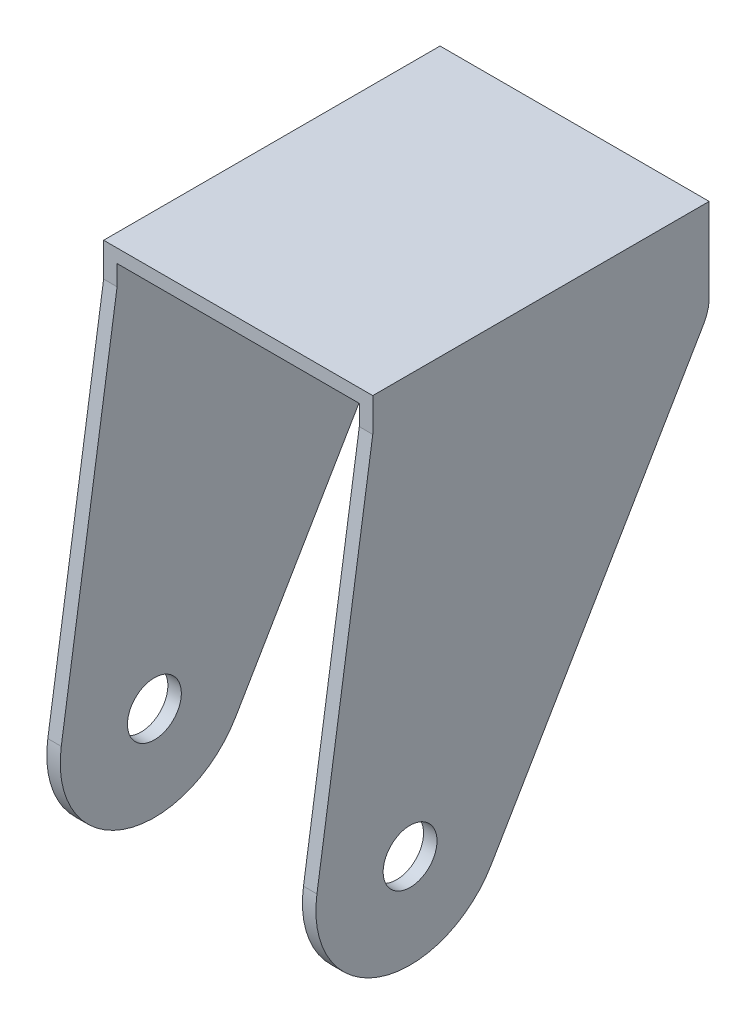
ISO-10303-21;
HEADER;
FILE_DESCRIPTION(('STEP AP214'),'2;1');
FILE_NAME('part.step','',(''),(''),'','','');
FILE_SCHEMA(('AUTOMOTIVE_DESIGN { 1 0 10303 214 1 1 1 1 }'));
ENDSEC;
DATA;
#1=APPLICATION_CONTEXT('core data for automotive mechanical design processes');
#2=APPLICATION_PROTOCOL_DEFINITION('international standard','automotive_design',2000,#1);
#3=PRODUCT_CONTEXT('',#1,'mechanical');
#4=PRODUCT('Part','Part','',(#3));
#5=PRODUCT_RELATED_PRODUCT_CATEGORY('part','',(#4));
#6=PRODUCT_DEFINITION_FORMATION('','',#4);
#7=PRODUCT_DEFINITION_CONTEXT('part definition',#1,'design');
#8=PRODUCT_DEFINITION('design','',#6,#7);
#9=PRODUCT_DEFINITION_SHAPE('','',#8);
#10=(LENGTH_UNIT() NAMED_UNIT(*) SI_UNIT(.MILLI.,.METRE.));
#11=(NAMED_UNIT(*) PLANE_ANGLE_UNIT() SI_UNIT($,.RADIAN.));
#12=(NAMED_UNIT(*) SI_UNIT($,.STERADIAN.) SOLID_ANGLE_UNIT());
#13=UNCERTAINTY_MEASURE_WITH_UNIT(LENGTH_MEASURE(1.E-05),#10,'distance_accuracy_value','');
#14=(GEOMETRIC_REPRESENTATION_CONTEXT(3) GLOBAL_UNCERTAINTY_ASSIGNED_CONTEXT((#13)) GLOBAL_UNIT_ASSIGNED_CONTEXT((#10,
#11,#12)) REPRESENTATION_CONTEXT('',''));
#15=CARTESIAN_POINT('',(0.,0.,0.));
#16=DIRECTION('',(0.,0.,1.));
#17=DIRECTION('',(1.,0.,0.));
#18=AXIS2_PLACEMENT_3D('',#15,#16,#17);
#19=CARTESIAN_POINT('',(0.,60.0885017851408,0.));
#20=DIRECTION('',(0.,1.,0.));
#21=DIRECTION('',(0.,0.,1.));
#22=AXIS2_PLACEMENT_3D('',#19,#20,#21);
#23=PLANE('',#22);
#24=DIRECTION('',(-0.466127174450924,0.,0.884717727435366));
#25=VECTOR('',#24,1.);
#26=CARTESIAN_POINT('',(-19.6951823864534,60.0885017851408,-10.3767104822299));
#27=LINE('',#26,#25);
#28=CARTESIAN_POINT('',(-9.64384241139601,60.0885017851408,-29.4543338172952));
#29=VERTEX_POINT('',#28);
#30=CARTESIAN_POINT('',(-18.,60.0885017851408,-13.5941970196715));
#31=VERTEX_POINT('',#30);
#32=EDGE_CURVE('E249',#29,#31,#27,.T.);
#33=ORIENTED_EDGE('',*,*,#32,.T.);
#34=CARTESIAN_POINT('',(-20.,60.0885017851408,-23.3921559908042));
#35=DIRECTION('',(0.,1.,0.));
#36=DIRECTION('',(0.,0.,1.));
#37=AXIS2_PLACEMENT_3D('',#34,#35,#36);
#38=CIRCLE('',#37,10.);
#39=CARTESIAN_POINT('',(-22.,60.0885017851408,-13.5941970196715));
#40=VERTEX_POINT('',#39);
#41=EDGE_CURVE('E230',#31,#40,#38,.F.);
#42=ORIENTED_EDGE('',*,*,#41,.T.);
#43=DIRECTION('',(-0.466127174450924,0.,-0.884717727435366));
#44=VECTOR('',#43,1.);
#45=CARTESIAN_POINT('',(-11.6138359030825,60.0885017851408,6.11892849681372));
#46=LINE('',#45,#44);
#47=CARTESIAN_POINT('',(-30.356157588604,60.0885017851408,-29.4543338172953));
#48=VERTEX_POINT('',#47);
#49=EDGE_CURVE('E255',#40,#48,#46,.T.);
#50=ORIENTED_EDGE('',*,*,#49,.T.);
#51=CARTESIAN_POINT('',(-20.,60.0885017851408,-23.3921559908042));
#52=DIRECTION('',(0.,1.,0.));
#53=DIRECTION('',(0.,0.,1.));
#54=AXIS2_PLACEMENT_3D('',#51,#52,#53);
#55=CIRCLE('',#54,12.);
#56=EDGE_CURVE('E252',#48,#29,#55,.T.);
#57=ORIENTED_EDGE('',*,*,#56,.T.);
#58=EDGE_LOOP('',(#33,#42,#50,#57));
#59=FACE_BOUND('',#58,.T.);
#60=DIRECTION('',(0.,0.,1.));
#61=VECTOR('',#60,1.);
#62=CARTESIAN_POINT('',(-38.,60.0885017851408,0.));
#63=LINE('',#62,#61);
#64=CARTESIAN_POINT('',(-38.,60.0885017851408,-44.4543338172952));
#65=VERTEX_POINT('',#64);
#66=CARTESIAN_POINT('',(-38.,60.0885017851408,5.54566618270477));
#67=VERTEX_POINT('',#66);
#68=EDGE_CURVE('E13',#65,#67,#63,.T.);
#69=ORIENTED_EDGE('',*,*,#68,.F.);
#70=DIRECTION('',(-1.,0.,0.));
#71=VECTOR('',#70,1.);
#72=CARTESIAN_POINT('',(-40.,60.0885017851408,-44.4543338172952));
#73=LINE('',#72,#71);
#74=CARTESIAN_POINT('',(-2.,60.0885017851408,-44.4543338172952));
#75=VERTEX_POINT('',#74);
#76=EDGE_CURVE('E191',#75,#65,#73,.T.);
#77=ORIENTED_EDGE('',*,*,#76,.F.);
#78=DIRECTION('',(0.,0.,1.));
#79=VECTOR('',#78,1.);
#80=CARTESIAN_POINT('',(-2.,60.0885017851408,0.));
#81=LINE('',#80,#79);
#82=CARTESIAN_POINT('',(-2.,60.0885017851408,5.54566618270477));
#83=VERTEX_POINT('',#82);
#84=EDGE_CURVE('E139',#75,#83,#81,.T.);
#85=ORIENTED_EDGE('',*,*,#84,.T.);
#86=DIRECTION('',(1.,0.,0.));
#87=VECTOR('',#86,1.);
#88=CARTESIAN_POINT('',(-40.,60.0885017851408,5.54566618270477));
#89=LINE('',#88,#87);
#90=EDGE_CURVE('E197',#67,#83,#89,.T.);
#91=ORIENTED_EDGE('',*,*,#90,.F.);
#92=EDGE_LOOP('',(#69,#77,#85,#91));
#93=FACE_BOUND('',#92,.T.);
#94=ADVANCED_FACE('F47',(#59,#93),#23,.F.);
#95=CARTESIAN_POINT('',(-2.,0.,0.));
#96=DIRECTION('',(1.,0.,0.));
#97=DIRECTION('',(0.,0.,-1.));
#98=AXIS2_PLACEMENT_3D('',#95,#96,#97);
#99=PLANE('',#98);
#100=CARTESIAN_POINT('',(-2.,0.,0.));
#101=DIRECTION('',(1.,0.,0.));
#102=DIRECTION('',(0.,0.,-1.));
#103=AXIS2_PLACEMENT_3D('',#100,#101,#102);
#104=CIRCLE('',#103,4.);
#105=CARTESIAN_POINT('',(-2.,0.,-4.00000000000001));
#106=VERTEX_POINT('',#105);
#107=EDGE_CURVE('E279',#106,#106,#104,.T.);
#108=ORIENTED_EDGE('',*,*,#107,.T.);
#109=EDGE_LOOP('',(#108));
#110=FACE_BOUND('',#109,.T.);
#111=ORIENTED_EDGE('',*,*,#84,.F.);
#112=DIRECTION('',(0.,1.,0.));
#113=VECTOR('',#112,1.);
#114=CARTESIAN_POINT('',(-2.,62.0885017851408,-44.4543338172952));
#115=LINE('',#114,#113);
#116=CARTESIAN_POINT('',(-2.,49.7190718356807,-44.4543338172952));
#117=VERTEX_POINT('',#116);
#118=EDGE_CURVE('E122',#117,#75,#115,.T.);
#119=ORIENTED_EDGE('',*,*,#118,.F.);
#120=CARTESIAN_POINT('',(-2.,49.7190718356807,-38.4543338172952));
#121=DIRECTION('',(1.,0.,0.));
#122=DIRECTION('',(0.,0.,1.));
#123=AXIS2_PLACEMENT_3D('',#120,#121,#122);
#124=CIRCLE('',#123,6.);
#125=CARTESIAN_POINT('',(-2.,46.6822168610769,-43.6290330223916));
#126=VERTEX_POINT('',#125);
#127=EDGE_CURVE('E136',#126,#117,#124,.T.);
#128=ORIENTED_EDGE('',*,*,#127,.F.);
#129=DIRECTION('',(0.,0.862449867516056,-0.506142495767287));
#130=VECTOR('',#129,1.);
#131=CARTESIAN_POINT('',(-2.,46.6822168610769,-43.6290330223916));
#132=LINE('',#131,#130);
#133=CARTESIAN_POINT('',(-2.,-7.08599494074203,-12.0742981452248));
#134=VERTEX_POINT('',#133);
#135=EDGE_CURVE('E143',#134,#126,#132,.T.);
#136=ORIENTED_EDGE('',*,*,#135,.F.);
#137=CARTESIAN_POINT('',(-2.,0.,0.));
#138=DIRECTION('',(1.,0.,0.));
#139=DIRECTION('',(0.,0.,-1.));
#140=AXIS2_PLACEMENT_3D('',#137,#138,#139);
#141=CIRCLE('',#140,14.);
#142=CARTESIAN_POINT('',(-2.,2.08850178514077,13.8433435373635));
#143=VERTEX_POINT('',#142);
#144=EDGE_CURVE('E145',#143,#134,#141,.T.);
#145=ORIENTED_EDGE('',*,*,#144,.F.);
#146=DIRECTION('',(0.,-0.988810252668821,0.149178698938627));
#147=VECTOR('',#146,1.);
#148=CARTESIAN_POINT('',(-2.,2.08850178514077,13.8433435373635));
#149=LINE('',#148,#147);
#150=CARTESIAN_POINT('',(-2.,57.0885017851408,5.54566618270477));
#151=VERTEX_POINT('',#150);
#152=EDGE_CURVE('E150',#151,#143,#149,.T.);
#153=ORIENTED_EDGE('',*,*,#152,.F.);
#154=DIRECTION('',(0.,-1.,0.));
#155=VECTOR('',#154,1.);
#156=CARTESIAN_POINT('',(-2.,57.0885017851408,5.54566618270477));
#157=LINE('',#156,#155);
#158=EDGE_CURVE('E140',#83,#151,#157,.T.);
#159=ORIENTED_EDGE('',*,*,#158,.F.);
#160=EDGE_LOOP('',(#111,#119,#128,#136,#145,#153,#159));
#161=FACE_BOUND('',#160,.T.);
#162=ADVANCED_FACE('F135',(#110,#161),#99,.F.);
#163=CARTESIAN_POINT('',(-2.,0.,0.));
#164=DIRECTION('',(1.,0.,0.));
#165=DIRECTION('',(0.,0.,-1.));
#166=AXIS2_PLACEMENT_3D('',#163,#164,#165);
#167=CYLINDRICAL_SURFACE('',#166,14.);
#168=CARTESIAN_POINT('',(0.,0.,0.));
#169=DIRECTION('',(1.,0.,0.));
#170=DIRECTION('',(0.,0.,-1.));
#171=AXIS2_PLACEMENT_3D('',#168,#169,#170);
#172=CIRCLE('',#171,14.);
#173=CARTESIAN_POINT('',(0.,2.08850178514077,13.8433435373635));
#174=VERTEX_POINT('',#173);
#175=CARTESIAN_POINT('',(0.,-7.08599494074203,-12.0742981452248));
#176=VERTEX_POINT('',#175);
#177=EDGE_CURVE('E152',#174,#176,#172,.T.);
#178=ORIENTED_EDGE('',*,*,#177,.F.);
#179=DIRECTION('',(1.,0.,0.));
#180=VECTOR('',#179,1.);
#181=CARTESIAN_POINT('',(-2.,2.08850178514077,13.8433435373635));
#182=LINE('',#181,#180);
#183=EDGE_CURVE('E56',#143,#174,#182,.T.);
#184=ORIENTED_EDGE('',*,*,#183,.F.);
#185=ORIENTED_EDGE('',*,*,#144,.T.);
#186=DIRECTION('',(1.,0.,0.));
#187=VECTOR('',#186,1.);
#188=CARTESIAN_POINT('',(-2.,-7.08599494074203,-12.0742981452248));
#189=LINE('',#188,#187);
#190=EDGE_CURVE('E107',#134,#176,#189,.T.);
#191=ORIENTED_EDGE('',*,*,#190,.T.);
#192=EDGE_LOOP('',(#178,#184,#185,#191));
#193=FACE_BOUND('',#192,.T.);
#194=ADVANCED_FACE('F49',(#193),#167,.T.);
#195=CARTESIAN_POINT('',(-2.,2.08850178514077,13.8433435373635));
#196=DIRECTION('',(0.,0.149178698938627,0.988810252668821));
#197=DIRECTION('',(0.,-0.988810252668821,0.149178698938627));
#198=AXIS2_PLACEMENT_3D('',#195,#196,#197);
#199=PLANE('',#198);
#200=DIRECTION('',(0.,-0.988810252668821,0.149178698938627));
#201=VECTOR('',#200,1.);
#202=CARTESIAN_POINT('',(0.,2.08850178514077,13.8433435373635));
#203=LINE('',#202,#201);
#204=CARTESIAN_POINT('',(0.,57.0885017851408,5.54566618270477));
#205=VERTEX_POINT('',#204);
#206=EDGE_CURVE('E166',#205,#174,#203,.T.);
#207=ORIENTED_EDGE('',*,*,#206,.F.);
#208=DIRECTION('',(1.,0.,0.));
#209=VECTOR('',#208,1.);
#210=CARTESIAN_POINT('',(-2.,57.0885017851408,5.54566618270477));
#211=LINE('',#210,#209);
#212=EDGE_CURVE('E170',#151,#205,#211,.T.);
#213=ORIENTED_EDGE('',*,*,#212,.F.);
#214=ORIENTED_EDGE('',*,*,#152,.T.);
#215=ORIENTED_EDGE('',*,*,#183,.T.);
#216=EDGE_LOOP('',(#207,#213,#214,#215));
#217=FACE_BOUND('',#216,.T.);
#218=ADVANCED_FACE('F182',(#217),#199,.T.);
#219=CARTESIAN_POINT('',(-2.,57.0885017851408,5.54566618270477));
#220=DIRECTION('',(0.,0.,1.));
#221=DIRECTION('',(1.,0.,0.));
#222=AXIS2_PLACEMENT_3D('',#219,#220,#221);
#223=PLANE('',#222);
#224=DIRECTION('',(0.,-1.,0.));
#225=VECTOR('',#224,1.);
#226=CARTESIAN_POINT('',(-38.,57.0885017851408,5.54566618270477));
#227=LINE('',#226,#225);
#228=CARTESIAN_POINT('',(-38.,57.0885017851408,5.54566618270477));
#229=VERTEX_POINT('',#228);
#230=EDGE_CURVE('E233',#67,#229,#227,.T.);
#231=ORIENTED_EDGE('',*,*,#230,.F.);
#232=ORIENTED_EDGE('',*,*,#90,.T.);
#233=ORIENTED_EDGE('',*,*,#158,.T.);
#234=ORIENTED_EDGE('',*,*,#212,.T.);
#235=DIRECTION('',(0.,-1.,0.));
#236=VECTOR('',#235,1.);
#237=CARTESIAN_POINT('',(0.,57.0885017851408,5.54566618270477));
#238=LINE('',#237,#236);
#239=CARTESIAN_POINT('',(0.,62.0885017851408,5.54566618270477));
#240=VERTEX_POINT('',#239);
#241=EDGE_CURVE('E164',#240,#205,#238,.T.);
#242=ORIENTED_EDGE('',*,*,#241,.F.);
#243=DIRECTION('',(1.,0.,0.));
#244=VECTOR('',#243,1.);
#245=CARTESIAN_POINT('',(-2.,62.0885017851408,5.54566618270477));
#246=LINE('',#245,#244);
#247=CARTESIAN_POINT('',(-40.,62.0885017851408,5.54566618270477));
#248=VERTEX_POINT('',#247);
#249=EDGE_CURVE('E173',#248,#240,#246,.T.);
#250=ORIENTED_EDGE('',*,*,#249,.F.);
#251=DIRECTION('',(0.,1.,0.));
#252=VECTOR('',#251,1.);
#253=CARTESIAN_POINT('',(-40.,60.0885017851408,5.54566618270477));
#254=LINE('',#253,#252);
#255=CARTESIAN_POINT('',(-40.,57.0885017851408,5.54566618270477));
#256=VERTEX_POINT('',#255);
#257=EDGE_CURVE('E188',#256,#248,#254,.T.);
#258=ORIENTED_EDGE('',*,*,#257,.F.);
#259=DIRECTION('',(-1.,0.,0.));
#260=VECTOR('',#259,1.);
#261=CARTESIAN_POINT('',(-38.,57.0885017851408,5.54566618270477));
#262=LINE('',#261,#260);
#263=EDGE_CURVE('E212',#229,#256,#262,.T.);
#264=ORIENTED_EDGE('',*,*,#263,.F.);
#265=EDGE_LOOP('',(#231,#232,#233,#234,#242,#250,#258,#264));
#266=FACE_BOUND('',#265,.T.);
#267=ADVANCED_FACE('F330',(#266),#223,.T.);
#268=CARTESIAN_POINT('',(-2.,62.0885017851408,5.54566618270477));
#269=DIRECTION('',(0.,1.,0.));
#270=DIRECTION('',(0.,0.,1.));
#271=AXIS2_PLACEMENT_3D('',#268,#269,#270);
#272=PLANE('',#271);
#273=ORIENTED_EDGE('',*,*,#249,.T.);
#274=DIRECTION('',(0.,0.,1.));
#275=VECTOR('',#274,1.);
#276=CARTESIAN_POINT('',(0.,62.0885017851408,5.54566618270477));
#277=LINE('',#276,#275);
#278=CARTESIAN_POINT('',(0.,62.0885017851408,-44.4543338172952));
#279=VERTEX_POINT('',#278);
#280=EDGE_CURVE('E161',#279,#240,#277,.T.);
#281=ORIENTED_EDGE('',*,*,#280,.F.);
#282=DIRECTION('',(1.,0.,0.));
#283=VECTOR('',#282,1.);
#284=CARTESIAN_POINT('',(-2.,62.0885017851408,-44.4543338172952));
#285=LINE('',#284,#283);
#286=CARTESIAN_POINT('',(-40.,62.0885017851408,-44.4543338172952));
#287=VERTEX_POINT('',#286);
#288=EDGE_CURVE('E129',#287,#279,#285,.T.);
#289=ORIENTED_EDGE('',*,*,#288,.F.);
#290=DIRECTION('',(0.,0.,1.));
#291=VECTOR('',#290,1.);
#292=CARTESIAN_POINT('',(-40.,62.0885017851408,-44.4543338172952));
#293=LINE('',#292,#291);
#294=EDGE_CURVE('E194',#287,#248,#293,.T.);
#295=ORIENTED_EDGE('',*,*,#294,.T.);
#296=EDGE_LOOP('',(#273,#281,#289,#295));
#297=FACE_BOUND('',#296,.T.);
#298=ADVANCED_FACE('F333',(#297),#272,.T.);
#299=CARTESIAN_POINT('',(-2.,62.0885017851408,-44.4543338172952));
#300=DIRECTION('',(0.,0.,-1.));
#301=DIRECTION('',(-1.,0.,0.));
#302=AXIS2_PLACEMENT_3D('',#299,#300,#301);
#303=PLANE('',#302);
#304=ORIENTED_EDGE('',*,*,#288,.T.);
#305=DIRECTION('',(0.,1.,0.));
#306=VECTOR('',#305,1.);
#307=CARTESIAN_POINT('',(0.,62.0885017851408,-44.4543338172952));
#308=LINE('',#307,#306);
#309=CARTESIAN_POINT('',(0.,49.7190718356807,-44.4543338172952));
#310=VERTEX_POINT('',#309);
#311=EDGE_CURVE('E124',#310,#279,#308,.T.);
#312=ORIENTED_EDGE('',*,*,#311,.F.);
#313=DIRECTION('',(1.,0.,0.));
#314=VECTOR('',#313,1.);
#315=CARTESIAN_POINT('',(-2.,49.7190718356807,-44.4543338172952));
#316=LINE('',#315,#314);
#317=EDGE_CURVE('E117',#117,#310,#316,.T.);
#318=ORIENTED_EDGE('',*,*,#317,.F.);
#319=ORIENTED_EDGE('',*,*,#118,.T.);
#320=ORIENTED_EDGE('',*,*,#76,.T.);
#321=DIRECTION('',(0.,1.,0.));
#322=VECTOR('',#321,1.);
#323=CARTESIAN_POINT('',(-38.,62.0885017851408,-44.4543338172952));
#324=LINE('',#323,#322);
#325=CARTESIAN_POINT('',(-38.,49.7190718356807,-44.4543338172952));
#326=VERTEX_POINT('',#325);
#327=EDGE_CURVE('E236',#326,#65,#324,.T.);
#328=ORIENTED_EDGE('',*,*,#327,.F.);
#329=DIRECTION('',(-1.,0.,0.));
#330=VECTOR('',#329,1.);
#331=CARTESIAN_POINT('',(-38.,49.7190718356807,-44.4543338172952));
#332=LINE('',#331,#330);
#333=CARTESIAN_POINT('',(-40.,49.7190718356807,-44.4543338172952));
#334=VERTEX_POINT('',#333);
#335=EDGE_CURVE('E209',#326,#334,#332,.T.);
#336=ORIENTED_EDGE('',*,*,#335,.T.);
#337=DIRECTION('',(0.,1.,0.));
#338=VECTOR('',#337,1.);
#339=CARTESIAN_POINT('',(-40.,60.0885017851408,-44.4543338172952));
#340=LINE('',#339,#338);
#341=EDGE_CURVE('E187',#334,#287,#340,.T.);
#342=ORIENTED_EDGE('',*,*,#341,.T.);
#343=EDGE_LOOP('',(#304,#312,#318,#319,#320,#328,#336,#342));
#344=FACE_BOUND('',#343,.T.);
#345=ADVANCED_FACE('F119',(#344),#303,.T.);
#346=CARTESIAN_POINT('',(-2.,49.7190718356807,-38.4543338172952));
#347=DIRECTION('',(1.,0.,0.));
#348=DIRECTION('',(0.,0.,-1.));
#349=AXIS2_PLACEMENT_3D('',#346,#347,#348);
#350=CYLINDRICAL_SURFACE('',#349,6.);
#351=CARTESIAN_POINT('',(0.,49.7190718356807,-38.4543338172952));
#352=DIRECTION('',(1.,0.,0.));
#353=DIRECTION('',(0.,0.,1.));
#354=AXIS2_PLACEMENT_3D('',#351,#352,#353);
#355=CIRCLE('',#354,6.);
#356=CARTESIAN_POINT('',(0.,46.6822168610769,-43.6290330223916));
#357=VERTEX_POINT('',#356);
#358=EDGE_CURVE('E158',#357,#310,#355,.T.);
#359=ORIENTED_EDGE('',*,*,#358,.F.);
#360=DIRECTION('',(1.,0.,0.));
#361=VECTOR('',#360,1.);
#362=CARTESIAN_POINT('',(-2.,46.6822168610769,-43.6290330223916));
#363=LINE('',#362,#361);
#364=EDGE_CURVE('E130',#126,#357,#363,.T.);
#365=ORIENTED_EDGE('',*,*,#364,.F.);
#366=ORIENTED_EDGE('',*,*,#127,.T.);
#367=ORIENTED_EDGE('',*,*,#317,.T.);
#368=EDGE_LOOP('',(#359,#365,#366,#367));
#369=FACE_BOUND('',#368,.T.);
#370=ADVANCED_FACE('F142',(#369),#350,.T.);
#371=CARTESIAN_POINT('',(-2.,46.6822168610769,-43.6290330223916));
#372=DIRECTION('',(0.,-0.506142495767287,-0.862449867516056));
#373=DIRECTION('',(0.,0.862449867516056,-0.506142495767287));
#374=AXIS2_PLACEMENT_3D('',#371,#372,#373);
#375=PLANE('',#374);
#376=DIRECTION('',(0.,0.862449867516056,-0.506142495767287));
#377=VECTOR('',#376,1.);
#378=CARTESIAN_POINT('',(0.,46.6822168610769,-43.6290330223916));
#379=LINE('',#378,#377);
#380=EDGE_CURVE('E155',#176,#357,#379,.T.);
#381=ORIENTED_EDGE('',*,*,#380,.F.);
#382=ORIENTED_EDGE('',*,*,#190,.F.);
#383=ORIENTED_EDGE('',*,*,#135,.T.);
#384=ORIENTED_EDGE('',*,*,#364,.T.);
#385=EDGE_LOOP('',(#381,#382,#383,#384));
#386=FACE_BOUND('',#385,.T.);
#387=ADVANCED_FACE('F177',(#386),#375,.T.);
#388=CARTESIAN_POINT('',(0.,0.,0.));
#389=DIRECTION('',(1.,0.,0.));
#390=DIRECTION('',(0.,0.,-1.));
#391=AXIS2_PLACEMENT_3D('',#388,#389,#390);
#392=PLANE('',#391);
#393=CARTESIAN_POINT('',(0.,0.,0.));
#394=DIRECTION('',(1.,0.,0.));
#395=DIRECTION('',(0.,0.,-1.));
#396=AXIS2_PLACEMENT_3D('',#393,#394,#395);
#397=CIRCLE('',#396,4.);
#398=CARTESIAN_POINT('',(0.,0.,-4.00000000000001));
#399=VERTEX_POINT('',#398);
#400=EDGE_CURVE('E282',#399,#399,#397,.T.);
#401=ORIENTED_EDGE('',*,*,#400,.F.);
#402=EDGE_LOOP('',(#401));
#403=FACE_BOUND('',#402,.T.);
#404=ORIENTED_EDGE('',*,*,#241,.T.);
#405=ORIENTED_EDGE('',*,*,#206,.T.);
#406=ORIENTED_EDGE('',*,*,#177,.T.);
#407=ORIENTED_EDGE('',*,*,#380,.T.);
#408=ORIENTED_EDGE('',*,*,#358,.T.);
#409=ORIENTED_EDGE('',*,*,#311,.T.);
#410=ORIENTED_EDGE('',*,*,#280,.T.);
#411=EDGE_LOOP('',(#404,#405,#406,#407,#408,#409,#410));
#412=FACE_BOUND('',#411,.T.);
#413=ADVANCED_FACE('F179',(#403,#412),#392,.T.);
#414=CARTESIAN_POINT('',(-40.,60.0885017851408,-44.4543338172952));
#415=DIRECTION('',(-1.,0.,0.));
#416=DIRECTION('',(0.,0.,1.));
#417=AXIS2_PLACEMENT_3D('',#414,#415,#416);
#418=PLANE('',#417);
#419=CARTESIAN_POINT('',(-40.,0.,0.));
#420=DIRECTION('',(-1.,0.,0.));
#421=DIRECTION('',(0.,0.,1.));
#422=AXIS2_PLACEMENT_3D('',#419,#420,#421);
#423=CIRCLE('',#422,4.);
#424=CARTESIAN_POINT('',(-40.,0.,4.));
#425=VERTEX_POINT('',#424);
#426=EDGE_CURVE('E285',#425,#425,#423,.T.);
#427=ORIENTED_EDGE('',*,*,#426,.F.);
#428=EDGE_LOOP('',(#427));
#429=FACE_BOUND('',#428,.T.);
#430=ORIENTED_EDGE('',*,*,#294,.F.);
#431=ORIENTED_EDGE('',*,*,#341,.F.);
#432=CARTESIAN_POINT('',(-40.,49.7190718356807,-38.4543338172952));
#433=DIRECTION('',(1.,0.,0.));
#434=DIRECTION('',(0.,0.,1.));
#435=AXIS2_PLACEMENT_3D('',#432,#433,#434);
#436=CIRCLE('',#435,6.);
#437=CARTESIAN_POINT('',(-40.,46.6822168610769,-43.6290330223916));
#438=VERTEX_POINT('',#437);
#439=EDGE_CURVE('E221',#438,#334,#436,.T.);
#440=ORIENTED_EDGE('',*,*,#439,.F.);
#441=DIRECTION('',(0.,0.862449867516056,-0.506142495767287));
#442=VECTOR('',#441,1.);
#443=CARTESIAN_POINT('',(-40.,46.6822168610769,-43.6290330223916));
#444=LINE('',#443,#442);
#445=CARTESIAN_POINT('',(-40.,-7.08599494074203,-12.0742981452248));
#446=VERTEX_POINT('',#445);
#447=EDGE_CURVE('E224',#446,#438,#444,.T.);
#448=ORIENTED_EDGE('',*,*,#447,.F.);
#449=CARTESIAN_POINT('',(-40.,0.,0.));
#450=DIRECTION('',(1.,0.,0.));
#451=DIRECTION('',(0.,0.,-1.));
#452=AXIS2_PLACEMENT_3D('',#449,#450,#451);
#453=CIRCLE('',#452,14.);
#454=CARTESIAN_POINT('',(-40.,2.08850178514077,13.8433435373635));
#455=VERTEX_POINT('',#454);
#456=EDGE_CURVE('E227',#455,#446,#453,.T.);
#457=ORIENTED_EDGE('',*,*,#456,.F.);
#458=DIRECTION('',(0.,-0.988810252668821,0.149178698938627));
#459=VECTOR('',#458,1.);
#460=CARTESIAN_POINT('',(-40.,2.08850178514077,13.8433435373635));
#461=LINE('',#460,#459);
#462=EDGE_CURVE('E217',#256,#455,#461,.T.);
#463=ORIENTED_EDGE('',*,*,#462,.F.);
#464=ORIENTED_EDGE('',*,*,#257,.T.);
#465=EDGE_LOOP('',(#430,#431,#440,#448,#457,#463,#464));
#466=FACE_BOUND('',#465,.T.);
#467=ADVANCED_FACE('F321',(#429,#466),#418,.T.);
#468=CARTESIAN_POINT('',(-38.,0.,0.));
#469=DIRECTION('',(-1.,0.,0.));
#470=DIRECTION('',(0.,0.,-1.));
#471=AXIS2_PLACEMENT_3D('',#468,#469,#470);
#472=PLANE('',#471);
#473=CARTESIAN_POINT('',(-38.,0.,0.));
#474=DIRECTION('',(-1.,0.,0.));
#475=DIRECTION('',(0.,0.,1.));
#476=AXIS2_PLACEMENT_3D('',#473,#474,#475);
#477=CIRCLE('',#476,4.);
#478=CARTESIAN_POINT('',(-38.,0.,4.));
#479=VERTEX_POINT('',#478);
#480=EDGE_CURVE('E51',#479,#479,#477,.T.);
#481=ORIENTED_EDGE('',*,*,#480,.T.);
#482=EDGE_LOOP('',(#481));
#483=FACE_BOUND('',#482,.T.);
#484=ORIENTED_EDGE('',*,*,#327,.T.);
#485=ORIENTED_EDGE('',*,*,#68,.T.);
#486=ORIENTED_EDGE('',*,*,#230,.T.);
#487=DIRECTION('',(0.,-0.988810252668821,0.149178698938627));
#488=VECTOR('',#487,1.);
#489=CARTESIAN_POINT('',(-38.,2.08850178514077,13.8433435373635));
#490=LINE('',#489,#488);
#491=CARTESIAN_POINT('',(-38.,2.08850178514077,13.8433435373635));
#492=VERTEX_POINT('',#491);
#493=EDGE_CURVE('E206',#229,#492,#490,.T.);
#494=ORIENTED_EDGE('',*,*,#493,.T.);
#495=CARTESIAN_POINT('',(-38.,0.,0.));
#496=DIRECTION('',(1.,0.,0.));
#497=DIRECTION('',(0.,0.,-1.));
#498=AXIS2_PLACEMENT_3D('',#495,#496,#497);
#499=CIRCLE('',#498,14.);
#500=CARTESIAN_POINT('',(-38.,-7.08599494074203,-12.0742981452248));
#501=VERTEX_POINT('',#500);
#502=EDGE_CURVE('E220',#492,#501,#499,.T.);
#503=ORIENTED_EDGE('',*,*,#502,.T.);
#504=DIRECTION('',(0.,0.862449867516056,-0.506142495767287));
#505=VECTOR('',#504,1.);
#506=CARTESIAN_POINT('',(-38.,46.6822168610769,-43.6290330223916));
#507=LINE('',#506,#505);
#508=CARTESIAN_POINT('',(-38.,46.6822168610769,-43.6290330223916));
#509=VERTEX_POINT('',#508);
#510=EDGE_CURVE('E242',#501,#509,#507,.T.);
#511=ORIENTED_EDGE('',*,*,#510,.T.);
#512=CARTESIAN_POINT('',(-38.,49.7190718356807,-38.4543338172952));
#513=DIRECTION('',(1.,0.,0.));
#514=DIRECTION('',(0.,0.,1.));
#515=AXIS2_PLACEMENT_3D('',#512,#513,#514);
#516=CIRCLE('',#515,6.);
#517=EDGE_CURVE('E239',#509,#326,#516,.T.);
#518=ORIENTED_EDGE('',*,*,#517,.T.);
#519=EDGE_LOOP('',(#484,#485,#486,#494,#503,#511,#518));
#520=FACE_BOUND('',#519,.T.);
#521=ADVANCED_FACE('F292',(#483,#520),#472,.F.);
#522=CARTESIAN_POINT('',(-38.,0.,0.));
#523=DIRECTION('',(-1.,0.,0.));
#524=DIRECTION('',(0.,0.,-1.));
#525=AXIS2_PLACEMENT_3D('',#522,#523,#524);
#526=CYLINDRICAL_SURFACE('',#525,14.);
#527=ORIENTED_EDGE('',*,*,#456,.T.);
#528=DIRECTION('',(-1.,0.,0.));
#529=VECTOR('',#528,1.);
#530=CARTESIAN_POINT('',(-38.,-7.08599494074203,-12.0742981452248));
#531=LINE('',#530,#529);
#532=EDGE_CURVE('E202',#501,#446,#531,.T.);
#533=ORIENTED_EDGE('',*,*,#532,.F.);
#534=ORIENTED_EDGE('',*,*,#502,.F.);
#535=DIRECTION('',(-1.,0.,0.));
#536=VECTOR('',#535,1.);
#537=CARTESIAN_POINT('',(-38.,2.08850178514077,13.8433435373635));
#538=LINE('',#537,#536);
#539=EDGE_CURVE('E198',#492,#455,#538,.T.);
#540=ORIENTED_EDGE('',*,*,#539,.T.);
#541=EDGE_LOOP('',(#527,#533,#534,#540));
#542=FACE_BOUND('',#541,.T.);
#543=ADVANCED_FACE('F319',(#542),#526,.T.);
#544=CARTESIAN_POINT('',(-38.,2.08850178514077,13.8433435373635));
#545=DIRECTION('',(0.,0.149178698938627,0.988810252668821));
#546=DIRECTION('',(0.,-0.988810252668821,0.149178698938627));
#547=AXIS2_PLACEMENT_3D('',#544,#545,#546);
#548=PLANE('',#547);
#549=ORIENTED_EDGE('',*,*,#462,.T.);
#550=ORIENTED_EDGE('',*,*,#539,.F.);
#551=ORIENTED_EDGE('',*,*,#493,.F.);
#552=ORIENTED_EDGE('',*,*,#263,.T.);
#553=EDGE_LOOP('',(#549,#550,#551,#552));
#554=FACE_BOUND('',#553,.T.);
#555=ADVANCED_FACE('F368',(#554),#548,.T.);
#556=CARTESIAN_POINT('',(-38.,49.7190718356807,-38.4543338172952));
#557=DIRECTION('',(-1.,0.,0.));
#558=DIRECTION('',(0.,0.,-1.));
#559=AXIS2_PLACEMENT_3D('',#556,#557,#558);
#560=CYLINDRICAL_SURFACE('',#559,6.);
#561=ORIENTED_EDGE('',*,*,#439,.T.);
#562=ORIENTED_EDGE('',*,*,#335,.F.);
#563=ORIENTED_EDGE('',*,*,#517,.F.);
#564=DIRECTION('',(-1.,0.,0.));
#565=VECTOR('',#564,1.);
#566=CARTESIAN_POINT('',(-38.,46.6822168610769,-43.6290330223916));
#567=LINE('',#566,#565);
#568=EDGE_CURVE('E205',#509,#438,#567,.T.);
#569=ORIENTED_EDGE('',*,*,#568,.T.);
#570=EDGE_LOOP('',(#561,#562,#563,#569));
#571=FACE_BOUND('',#570,.T.);
#572=ADVANCED_FACE('F375',(#571),#560,.T.);
#573=CARTESIAN_POINT('',(-38.,46.6822168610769,-43.6290330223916));
#574=DIRECTION('',(0.,-0.506142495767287,-0.862449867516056));
#575=DIRECTION('',(0.,0.862449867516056,-0.506142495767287));
#576=AXIS2_PLACEMENT_3D('',#573,#574,#575);
#577=PLANE('',#576);
#578=ORIENTED_EDGE('',*,*,#447,.T.);
#579=ORIENTED_EDGE('',*,*,#568,.F.);
#580=ORIENTED_EDGE('',*,*,#510,.F.);
#581=ORIENTED_EDGE('',*,*,#532,.T.);
#582=EDGE_LOOP('',(#578,#579,#580,#581));
#583=FACE_BOUND('',#582,.T.);
#584=ADVANCED_FACE('F383',(#583),#577,.T.);
#585=CARTESIAN_POINT('',(-20.,58.0885017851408,-23.3921559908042));
#586=DIRECTION('',(0.,1.,0.));
#587=DIRECTION('',(0.,0.,1.));
#588=AXIS2_PLACEMENT_3D('',#585,#586,#587);
#589=CYLINDRICAL_SURFACE('',#588,10.);
#590=ORIENTED_EDGE('',*,*,#41,.F.);
#591=DIRECTION('',(0.,1.,0.));
#592=VECTOR('',#591,1.);
#593=CARTESIAN_POINT('',(-18.,58.0885017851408,-13.5941970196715));
#594=LINE('',#593,#592);
#595=CARTESIAN_POINT('',(-18.,58.0885017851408,-13.5941970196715));
#596=VERTEX_POINT('',#595);
#597=EDGE_CURVE('E258',#596,#31,#594,.T.);
#598=ORIENTED_EDGE('',*,*,#597,.F.);
#599=CARTESIAN_POINT('',(-20.,58.0885017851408,-23.3921559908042));
#600=DIRECTION('',(0.,-1.,0.));
#601=DIRECTION('',(0.,0.,1.));
#602=AXIS2_PLACEMENT_3D('',#599,#600,#601);
#603=CIRCLE('',#602,10.);
#604=CARTESIAN_POINT('',(-22.,58.0885017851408,-13.5941970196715));
#605=VERTEX_POINT('',#604);
#606=EDGE_CURVE('E276',#596,#605,#603,.T.);
#607=ORIENTED_EDGE('',*,*,#606,.T.);
#608=DIRECTION('',(0.,1.,0.));
#609=VECTOR('',#608,1.);
#610=CARTESIAN_POINT('',(-22.,58.0885017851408,-13.5941970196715));
#611=LINE('',#610,#609);
#612=EDGE_CURVE('E259',#605,#40,#611,.T.);
#613=ORIENTED_EDGE('',*,*,#612,.T.);
#614=EDGE_LOOP('',(#590,#598,#607,#613));
#615=FACE_BOUND('',#614,.T.);
#616=ADVANCED_FACE('F390',(#615),#589,.F.);
#617=CARTESIAN_POINT('',(-18.,58.0885017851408,-13.5941970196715));
#618=DIRECTION('',(-0.884717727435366,0.,-0.466127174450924));
#619=DIRECTION('',(-0.466127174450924,0.,0.884717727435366));
#620=AXIS2_PLACEMENT_3D('',#617,#618,#619);
#621=PLANE('',#620);
#622=ORIENTED_EDGE('',*,*,#32,.F.);
#623=DIRECTION('',(0.,1.,0.));
#624=VECTOR('',#623,1.);
#625=CARTESIAN_POINT('',(-9.64384241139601,58.0885017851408,-29.4543338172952));
#626=LINE('',#625,#624);
#627=CARTESIAN_POINT('',(-9.64384241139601,58.0885017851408,-29.4543338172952));
#628=VERTEX_POINT('',#627);
#629=EDGE_CURVE('E264',#628,#29,#626,.T.);
#630=ORIENTED_EDGE('',*,*,#629,.F.);
#631=DIRECTION('',(-0.466127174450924,0.,0.884717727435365));
#632=VECTOR('',#631,1.);
#633=CARTESIAN_POINT('',(-18.,58.0885017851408,-13.5941970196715));
#634=LINE('',#633,#632);
#635=EDGE_CURVE('E262',#628,#596,#634,.T.);
#636=ORIENTED_EDGE('',*,*,#635,.T.);
#637=ORIENTED_EDGE('',*,*,#597,.T.);
#638=EDGE_LOOP('',(#622,#630,#636,#637));
#639=FACE_BOUND('',#638,.T.);
#640=ADVANCED_FACE('F397',(#639),#621,.T.);
#641=CARTESIAN_POINT('',(-20.,58.0885017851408,-23.3921559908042));
#642=DIRECTION('',(0.,1.,0.));
#643=DIRECTION('',(0.,0.,1.));
#644=AXIS2_PLACEMENT_3D('',#641,#642,#643);
#645=CYLINDRICAL_SURFACE('',#644,12.);
#646=ORIENTED_EDGE('',*,*,#56,.F.);
#647=DIRECTION('',(0.,1.,0.));
#648=VECTOR('',#647,1.);
#649=CARTESIAN_POINT('',(-30.356157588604,58.0885017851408,-29.4543338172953));
#650=LINE('',#649,#648);
#651=CARTESIAN_POINT('',(-30.356157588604,58.0885017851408,-29.4543338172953));
#652=VERTEX_POINT('',#651);
#653=EDGE_CURVE('E63',#652,#48,#650,.T.);
#654=ORIENTED_EDGE('',*,*,#653,.F.);
#655=CARTESIAN_POINT('',(-20.,58.0885017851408,-23.3921559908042));
#656=DIRECTION('',(0.,1.,0.));
#657=DIRECTION('',(0.,0.,1.));
#658=AXIS2_PLACEMENT_3D('',#655,#656,#657);
#659=CIRCLE('',#658,12.);
#660=EDGE_CURVE('E271',#652,#628,#659,.T.);
#661=ORIENTED_EDGE('',*,*,#660,.T.);
#662=ORIENTED_EDGE('',*,*,#629,.T.);
#663=EDGE_LOOP('',(#646,#654,#661,#662));
#664=FACE_BOUND('',#663,.T.);
#665=ADVANCED_FACE('F406',(#664),#645,.T.);
#666=CARTESIAN_POINT('',(-22.,58.0885017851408,-13.5941970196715));
#667=DIRECTION('',(0.884717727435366,0.,-0.466127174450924));
#668=DIRECTION('',(-0.466127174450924,0.,-0.884717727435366));
#669=AXIS2_PLACEMENT_3D('',#666,#667,#668);
#670=PLANE('',#669);
#671=ORIENTED_EDGE('',*,*,#49,.F.);
#672=ORIENTED_EDGE('',*,*,#612,.F.);
#673=DIRECTION('',(-0.466127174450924,0.,-0.884717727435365));
#674=VECTOR('',#673,1.);
#675=CARTESIAN_POINT('',(-22.,58.0885017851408,-13.5941970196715));
#676=LINE('',#675,#674);
#677=EDGE_CURVE('E274',#605,#652,#676,.T.);
#678=ORIENTED_EDGE('',*,*,#677,.T.);
#679=ORIENTED_EDGE('',*,*,#653,.T.);
#680=EDGE_LOOP('',(#671,#672,#678,#679));
#681=FACE_BOUND('',#680,.T.);
#682=ADVANCED_FACE('F305',(#681),#670,.T.);
#683=CARTESIAN_POINT('',(-20.,58.0885017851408,-23.3921559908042));
#684=DIRECTION('',(0.,1.,0.));
#685=DIRECTION('',(0.,0.,1.));
#686=AXIS2_PLACEMENT_3D('',#683,#684,#685);
#687=PLANE('',#686);
#688=ORIENTED_EDGE('',*,*,#606,.F.);
#689=ORIENTED_EDGE('',*,*,#635,.F.);
#690=ORIENTED_EDGE('',*,*,#660,.F.);
#691=ORIENTED_EDGE('',*,*,#677,.F.);
#692=EDGE_LOOP('',(#688,#689,#690,#691));
#693=FACE_BOUND('',#692,.T.);
#694=ADVANCED_FACE('F298',(#693),#687,.F.);
#695=CARTESIAN_POINT('',(4.00000000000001,0.,0.));
#696=DIRECTION('',(-1.,0.,0.));
#697=DIRECTION('',(0.,0.,1.));
#698=AXIS2_PLACEMENT_3D('',#695,#696,#697);
#699=CYLINDRICAL_SURFACE('',#698,4.);
#700=ORIENTED_EDGE('',*,*,#426,.T.);
#701=EDGE_LOOP('',(#700));
#702=FACE_BOUND('',#701,.T.);
#703=ORIENTED_EDGE('',*,*,#480,.F.);
#704=EDGE_LOOP('',(#703));
#705=FACE_BOUND('',#704,.T.);
#706=ADVANCED_FACE('F295',(#702,#705),#699,.F.);
#707=ORIENTED_EDGE('',*,*,#400,.T.);
#708=EDGE_LOOP('',(#707));
#709=FACE_BOUND('',#708,.T.);
#710=ORIENTED_EDGE('',*,*,#107,.F.);
#711=EDGE_LOOP('',(#710));
#712=FACE_BOUND('',#711,.T.);
#713=ADVANCED_FACE('F297',(#709,#712),#699,.F.);
#714=CLOSED_SHELL('',(#94,#162,#194,#218,#267,#298,#345,#370,#387,#413,#467,#521,#543,#555,#572,
#584,#616,#640,#665,#682,#694,#706,#713));
#715=MANIFOLD_SOLID_BREP('B2',#714);
#716=ADVANCED_BREP_SHAPE_REPRESENTATION('',(#18,#715),#14);
#717=SHAPE_DEFINITION_REPRESENTATION(#9,#716);
ENDSEC;
END-ISO-10303-21;
